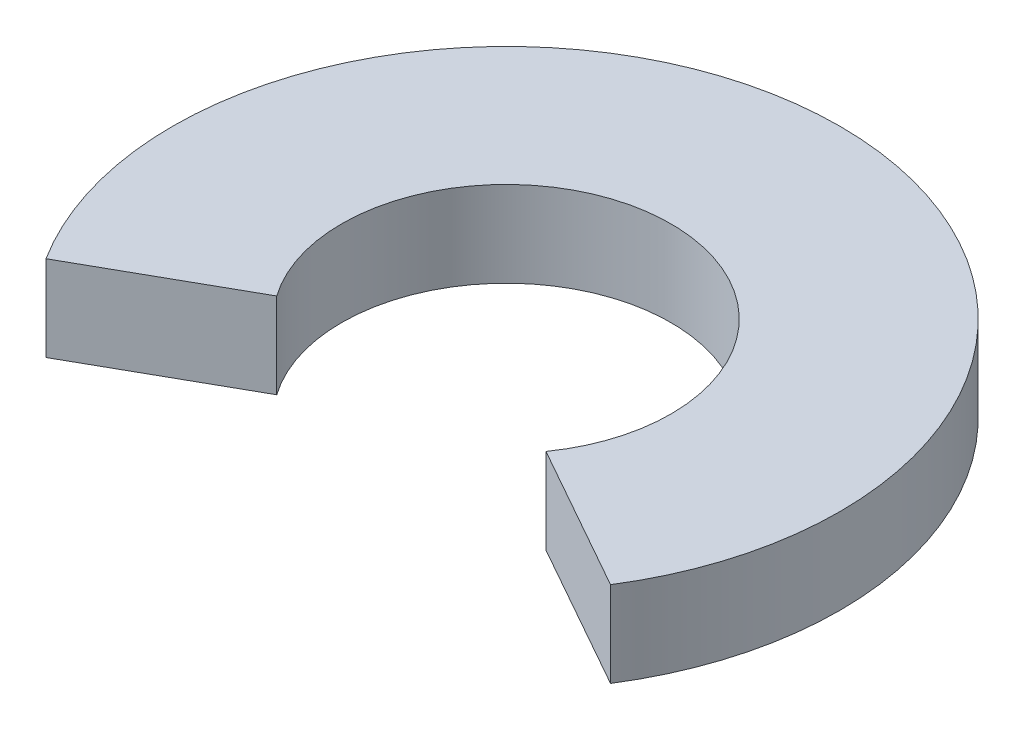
ISO-10303-21;
HEADER;
FILE_DESCRIPTION(('STEP AP214'),'2;1');
FILE_NAME('part.step','',(''),(''),'','','');
FILE_SCHEMA(('AUTOMOTIVE_DESIGN { 1 0 10303 214 1 1 1 1 }'));
ENDSEC;
DATA;
#1=APPLICATION_CONTEXT('core data for automotive mechanical design processes');
#2=APPLICATION_PROTOCOL_DEFINITION('international standard','automotive_design',2000,#1);
#3=PRODUCT_CONTEXT('',#1,'mechanical');
#4=PRODUCT('Part','Part','',(#3));
#5=PRODUCT_RELATED_PRODUCT_CATEGORY('part','',(#4));
#6=PRODUCT_DEFINITION_FORMATION('','',#4);
#7=PRODUCT_DEFINITION_CONTEXT('part definition',#1,'design');
#8=PRODUCT_DEFINITION('design','',#6,#7);
#9=PRODUCT_DEFINITION_SHAPE('','',#8);
#10=(LENGTH_UNIT() NAMED_UNIT(*) SI_UNIT(.MILLI.,.METRE.));
#11=(NAMED_UNIT(*) PLANE_ANGLE_UNIT() SI_UNIT($,.RADIAN.));
#12=(NAMED_UNIT(*) SI_UNIT($,.STERADIAN.) SOLID_ANGLE_UNIT());
#13=UNCERTAINTY_MEASURE_WITH_UNIT(LENGTH_MEASURE(1.E-05),#10,'distance_accuracy_value','');
#14=(GEOMETRIC_REPRESENTATION_CONTEXT(3) GLOBAL_UNCERTAINTY_ASSIGNED_CONTEXT((#13)) GLOBAL_UNIT_ASSIGNED_CONTEXT((#10,
#11,#12)) REPRESENTATION_CONTEXT('',''));
#15=CARTESIAN_POINT('',(0.,0.,0.));
#16=DIRECTION('',(0.,0.,1.));
#17=DIRECTION('',(1.,0.,0.));
#18=AXIS2_PLACEMENT_3D('',#15,#16,#17);
#19=CARTESIAN_POINT('',(0.,25.4,0.));
#20=DIRECTION('',(0.,1.,0.));
#21=DIRECTION('',(0.,0.,1.));
#22=AXIS2_PLACEMENT_3D('',#19,#20,#21);
#23=PLANE('',#22);
#24=CARTESIAN_POINT('',(0.,25.4,0.));
#25=DIRECTION('',(0.,1.,0.));
#26=DIRECTION('',(0.,0.,1.));
#27=AXIS2_PLACEMENT_3D('',#24,#25,#26);
#28=CIRCLE('',#27,48.895);
#29=CARTESIAN_POINT('',(39.9603423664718,25.3999999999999,28.176090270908));
#30=VERTEX_POINT('',#29);
#31=CARTESIAN_POINT('',(-39.9603423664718,25.4,28.176090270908));
#32=VERTEX_POINT('',#31);
#33=EDGE_CURVE('E40',#30,#32,#28,.T.);
#34=ORIENTED_EDGE('',*,*,#33,.F.);
#35=DIRECTION('',(0.871451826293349,0.,0.490481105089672));
#36=VECTOR('',#35,1.);
#37=CARTESIAN_POINT('',(39.9603423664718,25.3999999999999,28.176090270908));
#38=LINE('',#37,#36);
#39=CARTESIAN_POINT('',(83.7879889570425,25.4,52.8436988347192));
#40=VERTEX_POINT('',#39);
#41=EDGE_CURVE('E103',#30,#40,#38,.T.);
#42=ORIENTED_EDGE('',*,*,#41,.T.);
#43=CARTESIAN_POINT('',(0.,25.4,0.));
#44=DIRECTION('',(0.,1.,0.));
#45=DIRECTION('',(0.,0.,1.));
#46=AXIS2_PLACEMENT_3D('',#43,#44,#45);
#47=CIRCLE('',#46,99.06);
#48=CARTESIAN_POINT('',(-83.7879889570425,25.3999999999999,52.8436988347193));
#49=VERTEX_POINT('',#48);
#50=EDGE_CURVE('E160',#40,#49,#47,.T.);
#51=ORIENTED_EDGE('',*,*,#50,.T.);
#52=DIRECTION('',(0.871451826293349,0.,-0.490481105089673));
#53=VECTOR('',#52,1.);
#54=CARTESIAN_POINT('',(-83.7879889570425,25.3999999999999,52.8436988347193));
#55=LINE('',#54,#53);
#56=EDGE_CURVE('E105',#49,#32,#55,.T.);
#57=ORIENTED_EDGE('',*,*,#56,.T.);
#58=EDGE_LOOP('',(#34,#42,#51,#57));
#59=FACE_BOUND('',#58,.T.);
#60=ADVANCED_FACE('F36',(#59),#23,.T.);
#61=CARTESIAN_POINT('',(0.,0.,0.));
#62=DIRECTION('',(0.,1.,0.));
#63=DIRECTION('',(0.,0.,1.));
#64=AXIS2_PLACEMENT_3D('',#61,#62,#63);
#65=PLANE('',#64);
#66=DIRECTION('',(-0.871451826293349,0.,-0.490481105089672));
#67=VECTOR('',#66,1.);
#68=CARTESIAN_POINT('',(39.9603423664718,0.,28.176090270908));
#69=LINE('',#68,#67);
#70=CARTESIAN_POINT('',(83.7879889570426,0.,52.8436988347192));
#71=VERTEX_POINT('',#70);
#72=CARTESIAN_POINT('',(39.9603423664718,0.,28.176090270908));
#73=VERTEX_POINT('',#72);
#74=EDGE_CURVE('E126',#71,#73,#69,.T.);
#75=ORIENTED_EDGE('',*,*,#74,.T.);
#76=CARTESIAN_POINT('',(0.,0.,0.));
#77=DIRECTION('',(0.,1.,0.));
#78=DIRECTION('',(0.,0.,1.));
#79=AXIS2_PLACEMENT_3D('',#76,#77,#78);
#80=CIRCLE('',#79,48.895);
#81=CARTESIAN_POINT('',(-39.9603423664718,0.,28.176090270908));
#82=VERTEX_POINT('',#81);
#83=EDGE_CURVE('E110',#73,#82,#80,.T.);
#84=ORIENTED_EDGE('',*,*,#83,.T.);
#85=DIRECTION('',(-0.871451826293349,0.,0.490481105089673));
#86=VECTOR('',#85,1.);
#87=CARTESIAN_POINT('',(-83.7879889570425,0.,52.8436988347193));
#88=LINE('',#87,#86);
#89=CARTESIAN_POINT('',(-83.7879889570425,0.,52.8436988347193));
#90=VERTEX_POINT('',#89);
#91=EDGE_CURVE('E129',#82,#90,#88,.T.);
#92=ORIENTED_EDGE('',*,*,#91,.T.);
#93=CARTESIAN_POINT('',(0.,0.,0.));
#94=DIRECTION('',(0.,1.,0.));
#95=DIRECTION('',(0.,0.,1.));
#96=AXIS2_PLACEMENT_3D('',#93,#94,#95);
#97=CIRCLE('',#96,99.06);
#98=EDGE_CURVE('E109',#71,#90,#97,.T.);
#99=ORIENTED_EDGE('',*,*,#98,.F.);
#100=EDGE_LOOP('',(#75,#84,#92,#99));
#101=FACE_BOUND('',#100,.T.);
#102=CARTESIAN_POINT('',(0.,0.,0.));
#103=DIRECTION('',(0.,-1.,0.));
#104=DIRECTION('',(0.,0.,-1.));
#105=AXIS2_PLACEMENT_3D('',#102,#103,#104);
#106=CIRCLE('',#105,59.655);
#107=CARTESIAN_POINT('',(-51.4156298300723,0.,30.2514798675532));
#108=VERTEX_POINT('',#107);
#109=CARTESIAN_POINT('',(51.4156298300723,0.,30.2514798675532));
#110=VERTEX_POINT('',#109);
#111=EDGE_CURVE('E153',#108,#110,#106,.T.);
#112=ORIENTED_EDGE('',*,*,#111,.T.);
#113=DIRECTION('',(0.871451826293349,0.,0.490481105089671));
#114=VECTOR('',#113,1.);
#115=CARTESIAN_POINT('',(42.0367026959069,0.,24.9727181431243));
#116=LINE('',#115,#114);
#117=CARTESIAN_POINT('',(84.0987656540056,0.,48.6465994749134));
#118=VERTEX_POINT('',#117);
#119=EDGE_CURVE('E52',#110,#118,#116,.T.);
#120=ORIENTED_EDGE('',*,*,#119,.T.);
#121=CARTESIAN_POINT('',(0.,0.,0.));
#122=DIRECTION('',(0.,-1.,0.));
#123=DIRECTION('',(0.,0.,-1.));
#124=AXIS2_PLACEMENT_3D('',#121,#122,#123);
#125=CIRCLE('',#124,97.155);
#126=CARTESIAN_POINT('',(-84.0987656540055,0.,48.6465994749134));
#127=VERTEX_POINT('',#126);
#128=EDGE_CURVE('E149',#127,#118,#125,.T.);
#129=ORIENTED_EDGE('',*,*,#128,.F.);
#130=DIRECTION('',(0.871451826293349,0.,-0.490481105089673));
#131=VECTOR('',#130,1.);
#132=CARTESIAN_POINT('',(-85.7589943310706,0.,49.5810295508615));
#133=LINE('',#132,#131);
#134=EDGE_CURVE('E57',#127,#108,#133,.T.);
#135=ORIENTED_EDGE('',*,*,#134,.T.);
#136=EDGE_LOOP('',(#112,#120,#129,#135));
#137=FACE_BOUND('',#136,.T.);
#138=ADVANCED_FACE('F191',(#101,#137),#65,.F.);
#139=CARTESIAN_POINT('',(0.,25.4,0.));
#140=DIRECTION('',(0.,-1.,0.));
#141=DIRECTION('',(0.,0.,-1.));
#142=AXIS2_PLACEMENT_3D('',#139,#140,#141);
#143=CYLINDRICAL_SURFACE('',#142,99.06);
#144=ORIENTED_EDGE('',*,*,#50,.F.);
#145=DIRECTION('',(0.,1.,0.));
#146=VECTOR('',#145,1.);
#147=CARTESIAN_POINT('',(83.7879889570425,-53.6125739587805,52.8436988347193));
#148=LINE('',#147,#146);
#149=EDGE_CURVE('E117',#71,#40,#148,.T.);
#150=ORIENTED_EDGE('',*,*,#149,.F.);
#151=ORIENTED_EDGE('',*,*,#98,.T.);
#152=DIRECTION('',(0.,1.,0.));
#153=VECTOR('',#152,1.);
#154=CARTESIAN_POINT('',(-83.7879889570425,-53.6125739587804,52.8436988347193));
#155=LINE('',#154,#153);
#156=EDGE_CURVE('E132',#90,#49,#155,.T.);
#157=ORIENTED_EDGE('',*,*,#156,.T.);
#158=EDGE_LOOP('',(#144,#150,#151,#157));
#159=FACE_BOUND('',#158,.T.);
#160=ADVANCED_FACE('F38',(#159),#143,.T.);
#161=CARTESIAN_POINT('',(0.,25.4,0.));
#162=DIRECTION('',(0.,-1.,0.));
#163=DIRECTION('',(0.,0.,-1.));
#164=AXIS2_PLACEMENT_3D('',#161,#162,#163);
#165=CYLINDRICAL_SURFACE('',#164,48.895);
#166=ORIENTED_EDGE('',*,*,#83,.F.);
#167=DIRECTION('',(0.,1.,0.));
#168=VECTOR('',#167,1.);
#169=CARTESIAN_POINT('',(39.9603423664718,-53.6125739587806,28.176090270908));
#170=LINE('',#169,#168);
#171=EDGE_CURVE('E112',#73,#30,#170,.T.);
#172=ORIENTED_EDGE('',*,*,#171,.T.);
#173=ORIENTED_EDGE('',*,*,#33,.T.);
#174=DIRECTION('',(0.,1.,0.));
#175=VECTOR('',#174,1.);
#176=CARTESIAN_POINT('',(-39.9603423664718,-53.6125739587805,28.176090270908));
#177=LINE('',#176,#175);
#178=EDGE_CURVE('E130',#82,#32,#177,.T.);
#179=ORIENTED_EDGE('',*,*,#178,.F.);
#180=EDGE_LOOP('',(#166,#172,#173,#179));
#181=FACE_BOUND('',#180,.T.);
#182=ADVANCED_FACE('F113',(#181),#165,.F.);
#183=CARTESIAN_POINT('',(0.,300.195837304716,0.));
#184=DIRECTION('',(0.,-1.,0.));
#185=DIRECTION('',(0.,0.,-1.));
#186=AXIS2_PLACEMENT_3D('',#183,#184,#185);
#187=CYLINDRICAL_SURFACE('',#186,97.155);
#188=ORIENTED_EDGE('',*,*,#128,.T.);
#189=DIRECTION('',(0.,-1.,0.));
#190=VECTOR('',#189,1.);
#191=CARTESIAN_POINT('',(84.0987656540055,300.195837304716,48.6465994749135));
#192=LINE('',#191,#190);
#193=CARTESIAN_POINT('',(84.0987656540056,21.5899999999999,48.6465994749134));
#194=VERTEX_POINT('',#193);
#195=EDGE_CURVE('E145',#118,#194,#192,.F.);
#196=ORIENTED_EDGE('',*,*,#195,.T.);
#197=CARTESIAN_POINT('',(0.,21.5899999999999,0.));
#198=DIRECTION('',(0.,1.,0.));
#199=DIRECTION('',(0.,0.,1.));
#200=AXIS2_PLACEMENT_3D('',#197,#198,#199);
#201=CIRCLE('',#200,97.155);
#202=CARTESIAN_POINT('',(-84.0987656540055,21.59,48.6465994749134));
#203=VERTEX_POINT('',#202);
#204=EDGE_CURVE('E148',#203,#194,#201,.F.);
#205=ORIENTED_EDGE('',*,*,#204,.F.);
#206=DIRECTION('',(0.,-1.,0.));
#207=VECTOR('',#206,1.);
#208=CARTESIAN_POINT('',(-84.0987656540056,300.195837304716,48.6465994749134));
#209=LINE('',#208,#207);
#210=EDGE_CURVE('E140',#203,#127,#209,.T.);
#211=ORIENTED_EDGE('',*,*,#210,.T.);
#212=EDGE_LOOP('',(#188,#196,#205,#211));
#213=FACE_BOUND('',#212,.T.);
#214=ADVANCED_FACE('F171',(#213),#187,.F.);
#215=CARTESIAN_POINT('',(0.,300.195837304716,0.));
#216=DIRECTION('',(0.,-1.,0.));
#217=DIRECTION('',(0.,0.,-1.));
#218=AXIS2_PLACEMENT_3D('',#215,#216,#217);
#219=CYLINDRICAL_SURFACE('',#218,59.655);
#220=DIRECTION('',(0.,-1.,0.));
#221=VECTOR('',#220,1.);
#222=CARTESIAN_POINT('',(51.4156298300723,300.195837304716,30.2514798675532));
#223=LINE('',#222,#221);
#224=CARTESIAN_POINT('',(51.4156298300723,21.59,30.2514798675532));
#225=VERTEX_POINT('',#224);
#226=EDGE_CURVE('E143',#110,#225,#223,.F.);
#227=ORIENTED_EDGE('',*,*,#226,.F.);
#228=ORIENTED_EDGE('',*,*,#111,.F.);
#229=DIRECTION('',(0.,-1.,0.));
#230=VECTOR('',#229,1.);
#231=CARTESIAN_POINT('',(-51.4156298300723,300.195837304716,30.2514798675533));
#232=LINE('',#231,#230);
#233=CARTESIAN_POINT('',(-51.4156298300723,21.5899999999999,30.2514798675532));
#234=VERTEX_POINT('',#233);
#235=EDGE_CURVE('E138',#234,#108,#232,.T.);
#236=ORIENTED_EDGE('',*,*,#235,.F.);
#237=CARTESIAN_POINT('',(0.,21.5899999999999,0.));
#238=DIRECTION('',(0.,1.,0.));
#239=DIRECTION('',(0.,0.,1.));
#240=AXIS2_PLACEMENT_3D('',#237,#238,#239);
#241=CIRCLE('',#240,59.655);
#242=EDGE_CURVE('E152',#234,#225,#241,.F.);
#243=ORIENTED_EDGE('',*,*,#242,.T.);
#244=EDGE_LOOP('',(#227,#228,#236,#243));
#245=FACE_BOUND('',#244,.T.);
#246=ADVANCED_FACE('F176',(#245),#219,.T.);
#247=CARTESIAN_POINT('',(0.,21.5899999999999,0.));
#248=DIRECTION('',(0.,1.,0.));
#249=DIRECTION('',(0.,0.,1.));
#250=AXIS2_PLACEMENT_3D('',#247,#248,#249);
#251=PLANE('',#250);
#252=ORIENTED_EDGE('',*,*,#204,.T.);
#253=DIRECTION('',(-0.871451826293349,0.,-0.490481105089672));
#254=VECTOR('',#253,1.);
#255=CARTESIAN_POINT('',(-0.561263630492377,21.5899999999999,0.997213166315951));
#256=LINE('',#255,#254);
#257=EDGE_CURVE('E12',#194,#225,#256,.T.);
#258=ORIENTED_EDGE('',*,*,#257,.T.);
#259=ORIENTED_EDGE('',*,*,#242,.F.);
#260=DIRECTION('',(-0.871451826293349,0.,0.490481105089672));
#261=VECTOR('',#260,1.);
#262=CARTESIAN_POINT('',(0.561263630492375,21.59,0.997213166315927));
#263=LINE('',#262,#261);
#264=EDGE_CURVE('E45',#234,#203,#263,.T.);
#265=ORIENTED_EDGE('',*,*,#264,.T.);
#266=EDGE_LOOP('',(#252,#258,#259,#265));
#267=FACE_BOUND('',#266,.T.);
#268=ADVANCED_FACE('F167',(#267),#251,.F.);
#269=CARTESIAN_POINT('',(-85.7589943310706,-53.6125739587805,49.5810295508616));
#270=DIRECTION('',(-0.490481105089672,0.,-0.871451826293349));
#271=DIRECTION('',(-0.871451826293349,0.,0.490481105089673));
#272=AXIS2_PLACEMENT_3D('',#269,#270,#271);
#273=PLANE('',#272);
#274=ORIENTED_EDGE('',*,*,#210,.F.);
#275=ORIENTED_EDGE('',*,*,#264,.F.);
#276=ORIENTED_EDGE('',*,*,#235,.T.);
#277=ORIENTED_EDGE('',*,*,#134,.F.);
#278=EDGE_LOOP('',(#274,#275,#276,#277));
#279=FACE_BOUND('',#278,.T.);
#280=ADVANCED_FACE('F178',(#279),#273,.T.);
#281=CARTESIAN_POINT('',(-83.7879889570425,-53.6125739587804,52.8436988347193));
#282=DIRECTION('',(0.490481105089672,0.,0.871451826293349));
#283=DIRECTION('',(0.871451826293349,0.,-0.490481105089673));
#284=AXIS2_PLACEMENT_3D('',#281,#282,#283);
#285=PLANE('',#284);
#286=ORIENTED_EDGE('',*,*,#91,.F.);
#287=ORIENTED_EDGE('',*,*,#178,.T.);
#288=ORIENTED_EDGE('',*,*,#56,.F.);
#289=ORIENTED_EDGE('',*,*,#156,.F.);
#290=EDGE_LOOP('',(#286,#287,#288,#289));
#291=FACE_BOUND('',#290,.T.);
#292=ADVANCED_FACE('F180',(#291),#285,.T.);
#293=CARTESIAN_POINT('',(42.0367026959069,-53.6125739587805,24.9727181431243));
#294=DIRECTION('',(0.490481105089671,0.,-0.87145182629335));
#295=DIRECTION('',(-0.871451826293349,0.,-0.490481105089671));
#296=AXIS2_PLACEMENT_3D('',#293,#294,#295);
#297=PLANE('',#296);
#298=ORIENTED_EDGE('',*,*,#195,.F.);
#299=ORIENTED_EDGE('',*,*,#119,.F.);
#300=ORIENTED_EDGE('',*,*,#226,.T.);
#301=ORIENTED_EDGE('',*,*,#257,.F.);
#302=EDGE_LOOP('',(#298,#299,#300,#301));
#303=FACE_BOUND('',#302,.T.);
#304=ADVANCED_FACE('F173',(#303),#297,.T.);
#305=CARTESIAN_POINT('',(39.9603423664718,-53.6125739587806,28.176090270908));
#306=DIRECTION('',(-0.490481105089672,0.,0.871451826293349));
#307=DIRECTION('',(0.871451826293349,0.,0.490481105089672));
#308=AXIS2_PLACEMENT_3D('',#305,#306,#307);
#309=PLANE('',#308);
#310=ORIENTED_EDGE('',*,*,#74,.F.);
#311=ORIENTED_EDGE('',*,*,#149,.T.);
#312=ORIENTED_EDGE('',*,*,#41,.F.);
#313=ORIENTED_EDGE('',*,*,#171,.F.);
#314=EDGE_LOOP('',(#310,#311,#312,#313));
#315=FACE_BOUND('',#314,.T.);
#316=ADVANCED_FACE('F120',(#315),#309,.T.);
#317=CLOSED_SHELL('',(#60,#138,#160,#182,#214,#246,#268,#280,#292,#304,#316));
#318=MANIFOLD_SOLID_BREP('B2',#317);
#319=ADVANCED_BREP_SHAPE_REPRESENTATION('',(#18,#318),#14);
#320=SHAPE_DEFINITION_REPRESENTATION(#9,#319);
ENDSEC;
END-ISO-10303-21;
